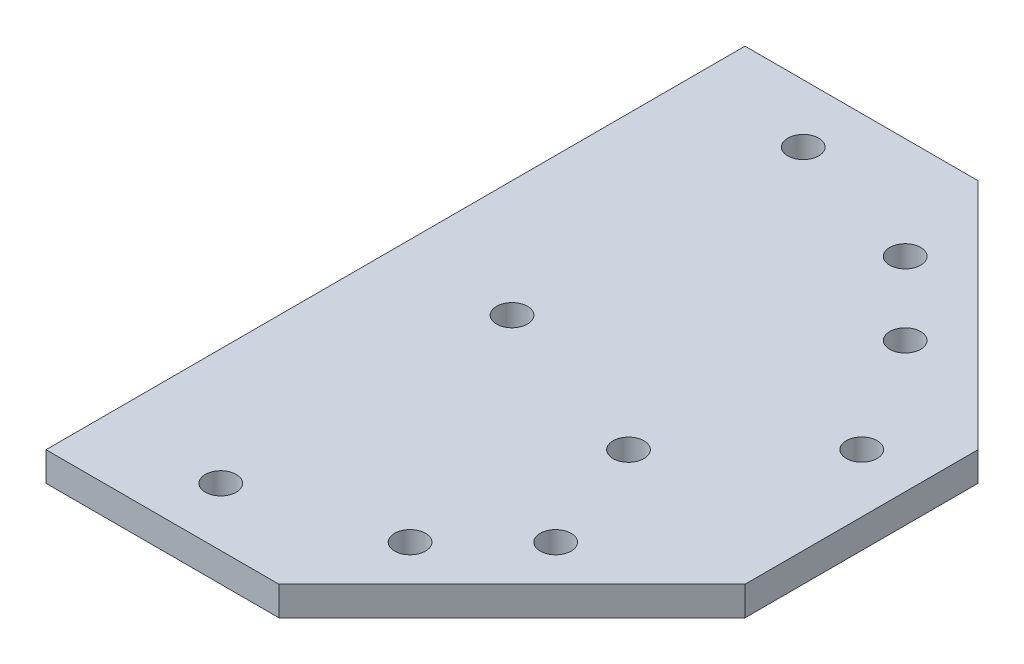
ISO-10303-21;
HEADER;
FILE_DESCRIPTION(('STEP AP214'),'2;1');
FILE_NAME('part.step','',(''),(''),'','','');
FILE_SCHEMA(('AUTOMOTIVE_DESIGN { 1 0 10303 214 1 1 1 1 }'));
ENDSEC;
DATA;
#1=APPLICATION_CONTEXT('core data for automotive mechanical design processes');
#2=APPLICATION_PROTOCOL_DEFINITION('international standard','automotive_design',2000,#1);
#3=PRODUCT_CONTEXT('',#1,'mechanical');
#4=PRODUCT('Part','Part','',(#3));
#5=PRODUCT_RELATED_PRODUCT_CATEGORY('part','',(#4));
#6=PRODUCT_DEFINITION_FORMATION('','',#4);
#7=PRODUCT_DEFINITION_CONTEXT('part definition',#1,'design');
#8=PRODUCT_DEFINITION('design','',#6,#7);
#9=PRODUCT_DEFINITION_SHAPE('','',#8);
#10=(LENGTH_UNIT() NAMED_UNIT(*) SI_UNIT(.MILLI.,.METRE.));
#11=(NAMED_UNIT(*) PLANE_ANGLE_UNIT() SI_UNIT($,.RADIAN.));
#12=(NAMED_UNIT(*) SI_UNIT($,.STERADIAN.) SOLID_ANGLE_UNIT());
#13=UNCERTAINTY_MEASURE_WITH_UNIT(LENGTH_MEASURE(1.E-05),#10,'distance_accuracy_value','');
#14=(GEOMETRIC_REPRESENTATION_CONTEXT(3) GLOBAL_UNCERTAINTY_ASSIGNED_CONTEXT((#13)) GLOBAL_UNIT_ASSIGNED_CONTEXT((#10,
#11,#12)) REPRESENTATION_CONTEXT('',''));
#15=CARTESIAN_POINT('',(0.,0.,0.));
#16=DIRECTION('',(0.,0.,1.));
#17=DIRECTION('',(1.,0.,0.));
#18=AXIS2_PLACEMENT_3D('',#15,#16,#17);
#19=CARTESIAN_POINT('',(0.,6.34999999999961,50.7999999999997));
#20=DIRECTION('',(0.,1.,0.));
#21=DIRECTION('',(0.,0.,1.));
#22=AXIS2_PLACEMENT_3D('',#19,#20,#21);
#23=PLANE('',#22);
#24=CARTESIAN_POINT('',(73.0249999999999,6.35000000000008,-63.5000000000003));
#25=DIRECTION('',(0.,1.,0.));
#26=DIRECTION('',(0.,0.,-1.));
#27=AXIS2_PLACEMENT_3D('',#24,#25,#26);
#28=CIRCLE('',#27,3.37311999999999);
#29=CARTESIAN_POINT('',(73.0249999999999,6.35000000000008,-66.8731200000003));
#30=VERTEX_POINT('',#29);
#31=EDGE_CURVE('E268',#30,#30,#28,.T.);
#32=ORIENTED_EDGE('',*,*,#31,.F.);
#33=EDGE_LOOP('',(#32));
#34=FACE_BOUND('',#33,.T.);
#35=CARTESIAN_POINT('',(25.4,6.35000000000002,-25.4000000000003));
#36=DIRECTION('',(0.,1.,0.));
#37=DIRECTION('',(0.,0.,1.));
#38=AXIS2_PLACEMENT_3D('',#35,#36,#37);
#39=CIRCLE('',#38,3.37312);
#40=CARTESIAN_POINT('',(25.4,6.35000000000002,-22.0268800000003));
#41=VERTEX_POINT('',#40);
#42=EDGE_CURVE('E280',#41,#41,#39,.T.);
#43=ORIENTED_EDGE('',*,*,#42,.F.);
#44=EDGE_LOOP('',(#43));
#45=FACE_BOUND('',#44,.T.);
#46=CARTESIAN_POINT('',(25.4,6.34999999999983,38.0999999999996));
#47=DIRECTION('',(0.,1.,0.));
#48=DIRECTION('',(0.,0.,-1.));
#49=AXIS2_PLACEMENT_3D('',#46,#47,#48);
#50=CIRCLE('',#49,3.37312);
#51=CARTESIAN_POINT('',(25.4,6.34999999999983,34.7268799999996));
#52=VERTEX_POINT('',#51);
#53=EDGE_CURVE('E292',#52,#52,#50,.T.);
#54=ORIENTED_EDGE('',*,*,#53,.F.);
#55=EDGE_LOOP('',(#54));
#56=FACE_BOUND('',#55,.T.);
#57=CARTESIAN_POINT('',(63.5,6.35000000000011,-12.7000000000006));
#58=DIRECTION('',(0.,1.,0.));
#59=DIRECTION('',(0.,0.,1.));
#60=AXIS2_PLACEMENT_3D('',#57,#58,#59);
#61=CIRCLE('',#60,3.37312);
#62=CARTESIAN_POINT('',(63.5,6.3500000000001,-9.32688000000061));
#63=VERTEX_POINT('',#62);
#64=EDGE_CURVE('E304',#63,#63,#61,.T.);
#65=ORIENTED_EDGE('',*,*,#64,.F.);
#66=EDGE_LOOP('',(#65));
#67=FACE_BOUND('',#66,.T.);
#68=DIRECTION('',(0.,0.,1.));
#69=VECTOR('',#68,1.);
#70=CARTESIAN_POINT('',(0.,6.34999999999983,-4.44089209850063E-13));
#71=LINE('',#70,#69);
#72=CARTESIAN_POINT('',(0.,6.35000000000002,-101.6));
#73=VERTEX_POINT('',#72);
#74=CARTESIAN_POINT('',(0.,6.34999999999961,50.7999999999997));
#75=VERTEX_POINT('',#74);
#76=EDGE_CURVE('E47',#73,#75,#71,.T.);
#77=ORIENTED_EDGE('',*,*,#76,.T.);
#78=DIRECTION('',(1.,0.,0.));
#79=VECTOR('',#78,1.);
#80=CARTESIAN_POINT('',(0.,6.34999999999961,50.7999999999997));
#81=LINE('',#80,#79);
#82=CARTESIAN_POINT('',(50.8,6.34999999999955,50.7999999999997));
#83=VERTEX_POINT('',#82);
#84=EDGE_CURVE('E86',#75,#83,#81,.T.);
#85=ORIENTED_EDGE('',*,*,#84,.T.);
#86=DIRECTION('',(0.707106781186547,0.,-0.707106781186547));
#87=VECTOR('',#86,1.);
#88=CARTESIAN_POINT('',(101.6,6.34999999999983,-4.44089209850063E-13));
#89=LINE('',#88,#87);
#90=CARTESIAN_POINT('',(101.6,6.34999999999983,-4.44089209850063E-13));
#91=VERTEX_POINT('',#90);
#92=EDGE_CURVE('E100',#83,#91,#89,.T.);
#93=ORIENTED_EDGE('',*,*,#92,.T.);
#94=DIRECTION('',(0.,0.,-1.));
#95=VECTOR('',#94,1.);
#96=CARTESIAN_POINT('',(101.6,6.34999999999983,-4.44089209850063E-13));
#97=LINE('',#96,#95);
#98=CARTESIAN_POINT('',(101.6,6.35000000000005,-50.8000000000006));
#99=VERTEX_POINT('',#98);
#100=EDGE_CURVE('E94',#91,#99,#97,.T.);
#101=ORIENTED_EDGE('',*,*,#100,.T.);
#102=DIRECTION('',(-0.707106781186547,0.,-0.707106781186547));
#103=VECTOR('',#102,1.);
#104=CARTESIAN_POINT('',(101.6,6.35000000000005,-50.8000000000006));
#105=LINE('',#104,#103);
#106=CARTESIAN_POINT('',(50.8,6.35000000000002,-101.6));
#107=VERTEX_POINT('',#106);
#108=EDGE_CURVE('E98',#99,#107,#105,.T.);
#109=ORIENTED_EDGE('',*,*,#108,.T.);
#110=DIRECTION('',(-1.,0.,0.));
#111=VECTOR('',#110,1.);
#112=CARTESIAN_POINT('',(0.,6.35000000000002,-101.6));
#113=LINE('',#112,#111);
#114=EDGE_CURVE('E114',#107,#73,#113,.T.);
#115=ORIENTED_EDGE('',*,*,#114,.T.);
#116=EDGE_LOOP('',(#77,#85,#93,#101,#109,#115));
#117=FACE_BOUND('',#116,.T.);
#118=CARTESIAN_POINT('',(88.9,6.35000000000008,-38.1534361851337));
#119=DIRECTION('',(0.,1.,0.));
#120=DIRECTION('',(0.,0.,1.));
#121=AXIS2_PLACEMENT_3D('',#118,#119,#120);
#122=CIRCLE('',#121,3.37312000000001);
#123=CARTESIAN_POINT('',(88.9,6.35000000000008,-34.7803161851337));
#124=VERTEX_POINT('',#123);
#125=EDGE_CURVE('E123',#124,#124,#122,.T.);
#126=ORIENTED_EDGE('',*,*,#125,.F.);
#127=EDGE_LOOP('',(#126));
#128=FACE_BOUND('',#127,.T.);
#129=CARTESIAN_POINT('',(25.4,6.35000000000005,-88.9000000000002));
#130=DIRECTION('',(0.,1.,0.));
#131=DIRECTION('',(0.,0.,1.));
#132=AXIS2_PLACEMENT_3D('',#129,#130,#131);
#133=CIRCLE('',#132,3.37311999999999);
#134=CARTESIAN_POINT('',(25.4,6.35000000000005,-85.5268800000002));
#135=VERTEX_POINT('',#134);
#136=EDGE_CURVE('E298',#135,#135,#133,.T.);
#137=ORIENTED_EDGE('',*,*,#136,.F.);
#138=EDGE_LOOP('',(#137));
#139=FACE_BOUND('',#138,.T.);
#140=CARTESIAN_POINT('',(73.0249999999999,6.34999999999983,12.6999999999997));
#141=DIRECTION('',(0.,1.,0.));
#142=DIRECTION('',(0.,0.,1.));
#143=AXIS2_PLACEMENT_3D('',#140,#141,#142);
#144=CIRCLE('',#143,3.37312);
#145=CARTESIAN_POINT('',(73.0249999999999,6.34999999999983,16.0731199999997));
#146=VERTEX_POINT('',#145);
#147=EDGE_CURVE('E286',#146,#146,#144,.T.);
#148=ORIENTED_EDGE('',*,*,#147,.F.);
#149=EDGE_LOOP('',(#148));
#150=FACE_BOUND('',#149,.T.);
#151=CARTESIAN_POINT('',(57.15,6.34999999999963,28.5749999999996));
#152=DIRECTION('',(0.,1.,0.));
#153=DIRECTION('',(0.,0.,1.));
#154=AXIS2_PLACEMENT_3D('',#151,#152,#153);
#155=CIRCLE('',#154,3.37311999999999);
#156=CARTESIAN_POINT('',(57.15,6.34999999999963,31.9481199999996));
#157=VERTEX_POINT('',#156);
#158=EDGE_CURVE('E274',#157,#157,#155,.T.);
#159=ORIENTED_EDGE('',*,*,#158,.F.);
#160=EDGE_LOOP('',(#159));
#161=FACE_BOUND('',#160,.T.);
#162=CARTESIAN_POINT('',(57.15,6.35000000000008,-79.3750000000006));
#163=DIRECTION('',(0.,1.,0.));
#164=DIRECTION('',(0.,0.,-1.));
#165=AXIS2_PLACEMENT_3D('',#162,#163,#164);
#166=CIRCLE('',#165,3.37311999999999);
#167=CARTESIAN_POINT('',(57.15,6.35000000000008,-82.7481200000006));
#168=VERTEX_POINT('',#167);
#169=EDGE_CURVE('E259',#168,#168,#166,.T.);
#170=ORIENTED_EDGE('',*,*,#169,.F.);
#171=EDGE_LOOP('',(#170));
#172=FACE_BOUND('',#171,.T.);
#173=ADVANCED_FACE('F30',(#34,#45,#56,#67,#117,#128,#139,#150,#161,#172),#23,.T.);
#174=CARTESIAN_POINT('',(0.,-2.4980018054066E-13,50.7999999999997));
#175=DIRECTION('',(0.,1.,0.));
#176=DIRECTION('',(0.,0.,1.));
#177=AXIS2_PLACEMENT_3D('',#174,#175,#176);
#178=PLANE('',#177);
#179=CARTESIAN_POINT('',(73.025,0.,-63.5000000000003));
#180=DIRECTION('',(0.,1.,0.));
#181=DIRECTION('',(0.,0.,-1.));
#182=AXIS2_PLACEMENT_3D('',#179,#180,#181);
#183=CIRCLE('',#182,3.37311999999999);
#184=CARTESIAN_POINT('',(73.025,0.,-66.8731200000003));
#185=VERTEX_POINT('',#184);
#186=EDGE_CURVE('E265',#185,#185,#183,.T.);
#187=ORIENTED_EDGE('',*,*,#186,.T.);
#188=EDGE_LOOP('',(#187));
#189=FACE_BOUND('',#188,.T.);
#190=CARTESIAN_POINT('',(25.4,0.,-25.4000000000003));
#191=DIRECTION('',(0.,1.,0.));
#192=DIRECTION('',(0.,0.,1.));
#193=AXIS2_PLACEMENT_3D('',#190,#191,#192);
#194=CIRCLE('',#193,3.37312);
#195=CARTESIAN_POINT('',(25.4,0.,-22.0268800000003));
#196=VERTEX_POINT('',#195);
#197=EDGE_CURVE('E277',#196,#196,#194,.T.);
#198=ORIENTED_EDGE('',*,*,#197,.T.);
#199=EDGE_LOOP('',(#198));
#200=FACE_BOUND('',#199,.T.);
#201=CARTESIAN_POINT('',(25.4,-2.4980018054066E-13,38.0999999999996));
#202=DIRECTION('',(0.,1.,0.));
#203=DIRECTION('',(0.,0.,-1.));
#204=AXIS2_PLACEMENT_3D('',#201,#202,#203);
#205=CIRCLE('',#204,3.37312);
#206=CARTESIAN_POINT('',(25.4,-2.49244681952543E-13,34.7268799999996));
#207=VERTEX_POINT('',#206);
#208=EDGE_CURVE('E289',#207,#207,#205,.T.);
#209=ORIENTED_EDGE('',*,*,#208,.T.);
#210=EDGE_LOOP('',(#209));
#211=FACE_BOUND('',#210,.T.);
#212=CARTESIAN_POINT('',(63.5,0.,-12.7000000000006));
#213=DIRECTION('',(0.,1.,0.));
#214=DIRECTION('',(0.,0.,1.));
#215=AXIS2_PLACEMENT_3D('',#212,#213,#214);
#216=CIRCLE('',#215,3.37312);
#217=CARTESIAN_POINT('',(63.5,0.,-9.32688000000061));
#218=VERTEX_POINT('',#217);
#219=EDGE_CURVE('E301',#218,#218,#216,.T.);
#220=ORIENTED_EDGE('',*,*,#219,.T.);
#221=EDGE_LOOP('',(#220));
#222=FACE_BOUND('',#221,.T.);
#223=DIRECTION('',(1.,0.,0.));
#224=VECTOR('',#223,1.);
#225=CARTESIAN_POINT('',(0.,-2.4980018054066E-13,50.7999999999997));
#226=LINE('',#225,#224);
#227=CARTESIAN_POINT('',(0.,-2.4980018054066E-13,50.7999999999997));
#228=VERTEX_POINT('',#227);
#229=CARTESIAN_POINT('',(50.8,-3.05311331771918E-13,50.7999999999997));
#230=VERTEX_POINT('',#229);
#231=EDGE_CURVE('E120',#228,#230,#226,.T.);
#232=ORIENTED_EDGE('',*,*,#231,.F.);
#233=DIRECTION('',(0.,0.,1.));
#234=VECTOR('',#233,1.);
#235=CARTESIAN_POINT('',(0.,-2.4980018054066E-13,-4.44089209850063E-13));
#236=LINE('',#235,#234);
#237=CARTESIAN_POINT('',(0.,0.,-101.6));
#238=VERTEX_POINT('',#237);
#239=EDGE_CURVE('E78',#238,#228,#236,.T.);
#240=ORIENTED_EDGE('',*,*,#239,.F.);
#241=DIRECTION('',(-1.,0.,0.));
#242=VECTOR('',#241,1.);
#243=CARTESIAN_POINT('',(0.,0.,-101.6));
#244=LINE('',#243,#242);
#245=CARTESIAN_POINT('',(50.8,0.,-101.6));
#246=VERTEX_POINT('',#245);
#247=EDGE_CURVE('E127',#246,#238,#244,.T.);
#248=ORIENTED_EDGE('',*,*,#247,.F.);
#249=DIRECTION('',(-0.707106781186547,0.,-0.707106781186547));
#250=VECTOR('',#249,1.);
#251=CARTESIAN_POINT('',(101.6,0.,-50.8000000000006));
#252=LINE('',#251,#250);
#253=CARTESIAN_POINT('',(101.6,0.,-50.8000000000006));
#254=VERTEX_POINT('',#253);
#255=EDGE_CURVE('E71',#254,#246,#252,.T.);
#256=ORIENTED_EDGE('',*,*,#255,.F.);
#257=DIRECTION('',(0.,0.,-1.));
#258=VECTOR('',#257,1.);
#259=CARTESIAN_POINT('',(101.6,-2.4980018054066E-13,-4.44089209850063E-13));
#260=LINE('',#259,#258);
#261=CARTESIAN_POINT('',(101.6,-2.4980018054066E-13,-4.44089209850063E-13));
#262=VERTEX_POINT('',#261);
#263=EDGE_CURVE('E108',#262,#254,#260,.T.);
#264=ORIENTED_EDGE('',*,*,#263,.F.);
#265=DIRECTION('',(0.707106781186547,0.,-0.707106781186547));
#266=VECTOR('',#265,1.);
#267=CARTESIAN_POINT('',(101.6,-2.4980018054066E-13,-4.44089209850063E-13));
#268=LINE('',#267,#266);
#269=EDGE_CURVE('E122',#230,#262,#268,.T.);
#270=ORIENTED_EDGE('',*,*,#269,.F.);
#271=EDGE_LOOP('',(#232,#240,#248,#256,#264,#270));
#272=FACE_BOUND('',#271,.T.);
#273=CARTESIAN_POINT('',(88.9,0.,-38.1534361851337));
#274=DIRECTION('',(0.,1.,0.));
#275=DIRECTION('',(0.,0.,1.));
#276=AXIS2_PLACEMENT_3D('',#273,#274,#275);
#277=CIRCLE('',#276,3.37312000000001);
#278=CARTESIAN_POINT('',(88.9,0.,-34.7803161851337));
#279=VERTEX_POINT('',#278);
#280=EDGE_CURVE('E307',#279,#279,#277,.T.);
#281=ORIENTED_EDGE('',*,*,#280,.T.);
#282=EDGE_LOOP('',(#281));
#283=FACE_BOUND('',#282,.T.);
#284=CARTESIAN_POINT('',(25.4,0.,-88.9000000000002));
#285=DIRECTION('',(0.,1.,0.));
#286=DIRECTION('',(0.,0.,1.));
#287=AXIS2_PLACEMENT_3D('',#284,#285,#286);
#288=CIRCLE('',#287,3.37311999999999);
#289=CARTESIAN_POINT('',(25.4,0.,-85.5268800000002));
#290=VERTEX_POINT('',#289);
#291=EDGE_CURVE('E295',#290,#290,#288,.T.);
#292=ORIENTED_EDGE('',*,*,#291,.T.);
#293=EDGE_LOOP('',(#292));
#294=FACE_BOUND('',#293,.T.);
#295=CARTESIAN_POINT('',(73.0249999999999,-2.4980018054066E-13,12.6999999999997));
#296=DIRECTION('',(0.,1.,0.));
#297=DIRECTION('',(0.,0.,1.));
#298=AXIS2_PLACEMENT_3D('',#295,#296,#297);
#299=CIRCLE('',#298,3.37312);
#300=CARTESIAN_POINT('',(73.0249999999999,-2.50355679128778E-13,16.0731199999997));
#301=VERTEX_POINT('',#300);
#302=EDGE_CURVE('E283',#301,#301,#299,.T.);
#303=ORIENTED_EDGE('',*,*,#302,.T.);
#304=EDGE_LOOP('',(#303));
#305=FACE_BOUND('',#304,.T.);
#306=CARTESIAN_POINT('',(57.15,-2.22044604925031E-13,28.5749999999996));
#307=DIRECTION('',(0.,1.,0.));
#308=DIRECTION('',(0.,0.,1.));
#309=AXIS2_PLACEMENT_3D('',#306,#307,#308);
#310=CIRCLE('',#309,3.37311999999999);
#311=CARTESIAN_POINT('',(57.15,-2.22600103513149E-13,31.9481199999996));
#312=VERTEX_POINT('',#311);
#313=EDGE_CURVE('E271',#312,#312,#310,.T.);
#314=ORIENTED_EDGE('',*,*,#313,.T.);
#315=EDGE_LOOP('',(#314));
#316=FACE_BOUND('',#315,.T.);
#317=CARTESIAN_POINT('',(57.15,0.,-79.3750000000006));
#318=DIRECTION('',(0.,1.,0.));
#319=DIRECTION('',(0.,0.,-1.));
#320=AXIS2_PLACEMENT_3D('',#317,#318,#319);
#321=CIRCLE('',#320,3.37311999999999);
#322=CARTESIAN_POINT('',(57.15,0.,-82.7481200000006));
#323=VERTEX_POINT('',#322);
#324=EDGE_CURVE('E262',#323,#323,#321,.T.);
#325=ORIENTED_EDGE('',*,*,#324,.T.);
#326=EDGE_LOOP('',(#325));
#327=FACE_BOUND('',#326,.T.);
#328=ADVANCED_FACE('F136',(#189,#200,#211,#222,#272,#283,#294,#305,#316,#327),#178,.F.);
#329=CARTESIAN_POINT('',(0.,6.34999999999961,50.7999999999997));
#330=DIRECTION('',(0.,0.,-1.));
#331=DIRECTION('',(-1.,0.,0.));
#332=AXIS2_PLACEMENT_3D('',#329,#330,#331);
#333=PLANE('',#332);
#334=ORIENTED_EDGE('',*,*,#231,.T.);
#335=DIRECTION('',(0.,-1.,0.));
#336=VECTOR('',#335,1.);
#337=CARTESIAN_POINT('',(50.8,6.34999999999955,50.7999999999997));
#338=LINE('',#337,#336);
#339=EDGE_CURVE('E39',#83,#230,#338,.T.);
#340=ORIENTED_EDGE('',*,*,#339,.F.);
#341=ORIENTED_EDGE('',*,*,#84,.F.);
#342=DIRECTION('',(0.,-1.,0.));
#343=VECTOR('',#342,1.);
#344=CARTESIAN_POINT('',(0.,6.34999999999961,50.7999999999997));
#345=LINE('',#344,#343);
#346=EDGE_CURVE('E11',#75,#228,#345,.T.);
#347=ORIENTED_EDGE('',*,*,#346,.T.);
#348=EDGE_LOOP('',(#334,#340,#341,#347));
#349=FACE_BOUND('',#348,.T.);
#350=ADVANCED_FACE('F32',(#349),#333,.F.);
#351=CARTESIAN_POINT('',(101.6,6.34999999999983,-4.44089209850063E-13));
#352=DIRECTION('',(-0.707106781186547,0.,-0.707106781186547));
#353=DIRECTION('',(-0.707106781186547,0.,0.707106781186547));
#354=AXIS2_PLACEMENT_3D('',#351,#352,#353);
#355=PLANE('',#354);
#356=ORIENTED_EDGE('',*,*,#269,.T.);
#357=DIRECTION('',(0.,-1.,0.));
#358=VECTOR('',#357,1.);
#359=CARTESIAN_POINT('',(101.6,6.34999999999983,-4.44089209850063E-13));
#360=LINE('',#359,#358);
#361=EDGE_CURVE('E109',#91,#262,#360,.T.);
#362=ORIENTED_EDGE('',*,*,#361,.F.);
#363=ORIENTED_EDGE('',*,*,#92,.F.);
#364=ORIENTED_EDGE('',*,*,#339,.T.);
#365=EDGE_LOOP('',(#356,#362,#363,#364));
#366=FACE_BOUND('',#365,.T.);
#367=ADVANCED_FACE('F135',(#366),#355,.F.);
#368=CARTESIAN_POINT('',(101.6,6.34999999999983,-4.44089209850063E-13));
#369=DIRECTION('',(-1.,0.,0.));
#370=DIRECTION('',(0.,0.,1.));
#371=AXIS2_PLACEMENT_3D('',#368,#369,#370);
#372=PLANE('',#371);
#373=ORIENTED_EDGE('',*,*,#263,.T.);
#374=DIRECTION('',(0.,-1.,0.));
#375=VECTOR('',#374,1.);
#376=CARTESIAN_POINT('',(101.6,6.35000000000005,-50.8000000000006));
#377=LINE('',#376,#375);
#378=EDGE_CURVE('E105',#99,#254,#377,.T.);
#379=ORIENTED_EDGE('',*,*,#378,.F.);
#380=ORIENTED_EDGE('',*,*,#100,.F.);
#381=ORIENTED_EDGE('',*,*,#361,.T.);
#382=EDGE_LOOP('',(#373,#379,#380,#381));
#383=FACE_BOUND('',#382,.T.);
#384=ADVANCED_FACE('F106',(#383),#372,.F.);
#385=CARTESIAN_POINT('',(101.6,6.35000000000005,-50.8000000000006));
#386=DIRECTION('',(-0.707106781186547,0.,0.707106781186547));
#387=DIRECTION('',(0.707106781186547,0.,0.707106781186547));
#388=AXIS2_PLACEMENT_3D('',#385,#386,#387);
#389=PLANE('',#388);
#390=ORIENTED_EDGE('',*,*,#255,.T.);
#391=DIRECTION('',(0.,-1.,0.));
#392=VECTOR('',#391,1.);
#393=CARTESIAN_POINT('',(50.8,6.35000000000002,-101.6));
#394=LINE('',#393,#392);
#395=EDGE_CURVE('E110',#107,#246,#394,.T.);
#396=ORIENTED_EDGE('',*,*,#395,.F.);
#397=ORIENTED_EDGE('',*,*,#108,.F.);
#398=ORIENTED_EDGE('',*,*,#378,.T.);
#399=EDGE_LOOP('',(#390,#396,#397,#398));
#400=FACE_BOUND('',#399,.T.);
#401=ADVANCED_FACE('F112',(#400),#389,.F.);
#402=CARTESIAN_POINT('',(0.,6.35000000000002,-101.6));
#403=DIRECTION('',(0.,0.,1.));
#404=DIRECTION('',(1.,0.,0.));
#405=AXIS2_PLACEMENT_3D('',#402,#403,#404);
#406=PLANE('',#405);
#407=ORIENTED_EDGE('',*,*,#247,.T.);
#408=DIRECTION('',(0.,-1.,0.));
#409=VECTOR('',#408,1.);
#410=CARTESIAN_POINT('',(0.,6.35000000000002,-101.6));
#411=LINE('',#410,#409);
#412=EDGE_CURVE('E116',#73,#238,#411,.T.);
#413=ORIENTED_EDGE('',*,*,#412,.F.);
#414=ORIENTED_EDGE('',*,*,#114,.F.);
#415=ORIENTED_EDGE('',*,*,#395,.T.);
#416=EDGE_LOOP('',(#407,#413,#414,#415));
#417=FACE_BOUND('',#416,.T.);
#418=ADVANCED_FACE('F140',(#417),#406,.F.);
#419=CARTESIAN_POINT('',(0.,6.34999999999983,-4.44089209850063E-13));
#420=DIRECTION('',(1.,0.,0.));
#421=DIRECTION('',(0.,0.,-1.));
#422=AXIS2_PLACEMENT_3D('',#419,#420,#421);
#423=PLANE('',#422);
#424=ORIENTED_EDGE('',*,*,#239,.T.);
#425=ORIENTED_EDGE('',*,*,#346,.F.);
#426=ORIENTED_EDGE('',*,*,#76,.F.);
#427=ORIENTED_EDGE('',*,*,#412,.T.);
#428=EDGE_LOOP('',(#424,#425,#426,#427));
#429=FACE_BOUND('',#428,.T.);
#430=ADVANCED_FACE('F141',(#429),#423,.F.);
#431=CARTESIAN_POINT('',(88.9,6.35000000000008,-38.1534361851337));
#432=DIRECTION('',(0.,-1.,0.));
#433=DIRECTION('',(0.,0.,-1.));
#434=AXIS2_PLACEMENT_3D('',#431,#432,#433);
#435=CYLINDRICAL_SURFACE('',#434,3.37312000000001);
#436=ORIENTED_EDGE('',*,*,#125,.T.);
#437=EDGE_LOOP('',(#436));
#438=FACE_BOUND('',#437,.T.);
#439=ORIENTED_EDGE('',*,*,#280,.F.);
#440=EDGE_LOOP('',(#439));
#441=FACE_BOUND('',#440,.T.);
#442=ADVANCED_FACE('F157',(#438,#441),#435,.F.);
#443=CARTESIAN_POINT('',(63.5,6.35000000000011,-12.7000000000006));
#444=DIRECTION('',(0.,-1.,0.));
#445=DIRECTION('',(0.,0.,-1.));
#446=AXIS2_PLACEMENT_3D('',#443,#444,#445);
#447=CYLINDRICAL_SURFACE('',#446,3.37312);
#448=ORIENTED_EDGE('',*,*,#64,.T.);
#449=EDGE_LOOP('',(#448));
#450=FACE_BOUND('',#449,.T.);
#451=ORIENTED_EDGE('',*,*,#219,.F.);
#452=EDGE_LOOP('',(#451));
#453=FACE_BOUND('',#452,.T.);
#454=ADVANCED_FACE('F191',(#450,#453),#447,.F.);
#455=CARTESIAN_POINT('',(25.4,6.35000000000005,-88.9000000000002));
#456=DIRECTION('',(0.,-1.,0.));
#457=DIRECTION('',(0.,0.,-1.));
#458=AXIS2_PLACEMENT_3D('',#455,#456,#457);
#459=CYLINDRICAL_SURFACE('',#458,3.37311999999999);
#460=ORIENTED_EDGE('',*,*,#136,.T.);
#461=EDGE_LOOP('',(#460));
#462=FACE_BOUND('',#461,.T.);
#463=ORIENTED_EDGE('',*,*,#291,.F.);
#464=EDGE_LOOP('',(#463));
#465=FACE_BOUND('',#464,.T.);
#466=ADVANCED_FACE('F198',(#462,#465),#459,.F.);
#467=CARTESIAN_POINT('',(25.4,6.34999999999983,38.0999999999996));
#468=DIRECTION('',(0.,-1.,0.));
#469=DIRECTION('',(0.,0.,-1.));
#470=AXIS2_PLACEMENT_3D('',#467,#468,#469);
#471=CYLINDRICAL_SURFACE('',#470,3.37312);
#472=ORIENTED_EDGE('',*,*,#53,.T.);
#473=EDGE_LOOP('',(#472));
#474=FACE_BOUND('',#473,.T.);
#475=ORIENTED_EDGE('',*,*,#208,.F.);
#476=EDGE_LOOP('',(#475));
#477=FACE_BOUND('',#476,.T.);
#478=ADVANCED_FACE('F205',(#474,#477),#471,.F.);
#479=CARTESIAN_POINT('',(73.0249999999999,6.34999999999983,12.6999999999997));
#480=DIRECTION('',(0.,-1.,0.));
#481=DIRECTION('',(0.,0.,-1.));
#482=AXIS2_PLACEMENT_3D('',#479,#480,#481);
#483=CYLINDRICAL_SURFACE('',#482,3.37312);
#484=ORIENTED_EDGE('',*,*,#147,.T.);
#485=EDGE_LOOP('',(#484));
#486=FACE_BOUND('',#485,.T.);
#487=ORIENTED_EDGE('',*,*,#302,.F.);
#488=EDGE_LOOP('',(#487));
#489=FACE_BOUND('',#488,.T.);
#490=ADVANCED_FACE('F213',(#486,#489),#483,.F.);
#491=CARTESIAN_POINT('',(25.4,6.35000000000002,-25.4000000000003));
#492=DIRECTION('',(0.,-1.,0.));
#493=DIRECTION('',(0.,0.,-1.));
#494=AXIS2_PLACEMENT_3D('',#491,#492,#493);
#495=CYLINDRICAL_SURFACE('',#494,3.37312);
#496=ORIENTED_EDGE('',*,*,#42,.T.);
#497=EDGE_LOOP('',(#496));
#498=FACE_BOUND('',#497,.T.);
#499=ORIENTED_EDGE('',*,*,#197,.F.);
#500=EDGE_LOOP('',(#499));
#501=FACE_BOUND('',#500,.T.);
#502=ADVANCED_FACE('F221',(#498,#501),#495,.F.);
#503=CARTESIAN_POINT('',(57.15,6.34999999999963,28.5749999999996));
#504=DIRECTION('',(0.,-1.,0.));
#505=DIRECTION('',(0.,0.,-1.));
#506=AXIS2_PLACEMENT_3D('',#503,#504,#505);
#507=CYLINDRICAL_SURFACE('',#506,3.37311999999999);
#508=ORIENTED_EDGE('',*,*,#158,.T.);
#509=EDGE_LOOP('',(#508));
#510=FACE_BOUND('',#509,.T.);
#511=ORIENTED_EDGE('',*,*,#313,.F.);
#512=EDGE_LOOP('',(#511));
#513=FACE_BOUND('',#512,.T.);
#514=ADVANCED_FACE('F229',(#510,#513),#507,.F.);
#515=CARTESIAN_POINT('',(73.0249999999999,6.35000000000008,-63.5000000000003));
#516=DIRECTION('',(0.,-1.,0.));
#517=DIRECTION('',(0.,0.,-1.));
#518=AXIS2_PLACEMENT_3D('',#515,#516,#517);
#519=CYLINDRICAL_SURFACE('',#518,3.37311999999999);
#520=ORIENTED_EDGE('',*,*,#31,.T.);
#521=EDGE_LOOP('',(#520));
#522=FACE_BOUND('',#521,.T.);
#523=ORIENTED_EDGE('',*,*,#186,.F.);
#524=EDGE_LOOP('',(#523));
#525=FACE_BOUND('',#524,.T.);
#526=ADVANCED_FACE('F237',(#522,#525),#519,.F.);
#527=CARTESIAN_POINT('',(57.15,6.35000000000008,-79.3750000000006));
#528=DIRECTION('',(0.,-1.,0.));
#529=DIRECTION('',(0.,0.,-1.));
#530=AXIS2_PLACEMENT_3D('',#527,#528,#529);
#531=CYLINDRICAL_SURFACE('',#530,3.37311999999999);
#532=ORIENTED_EDGE('',*,*,#169,.T.);
#533=EDGE_LOOP('',(#532));
#534=FACE_BOUND('',#533,.T.);
#535=ORIENTED_EDGE('',*,*,#324,.F.);
#536=EDGE_LOOP('',(#535));
#537=FACE_BOUND('',#536,.T.);
#538=ADVANCED_FACE('F245',(#534,#537),#531,.F.);
#539=CLOSED_SHELL('',(#173,#328,#350,#367,#384,#401,#418,#430,#442,#454,#466,#478,#490,#502,
#514,#526,#538));
#540=MANIFOLD_SOLID_BREP('B2',#539);
#541=ADVANCED_BREP_SHAPE_REPRESENTATION('',(#18,#540),#14);
#542=SHAPE_DEFINITION_REPRESENTATION(#9,#541);
ENDSEC;
END-ISO-10303-21;
